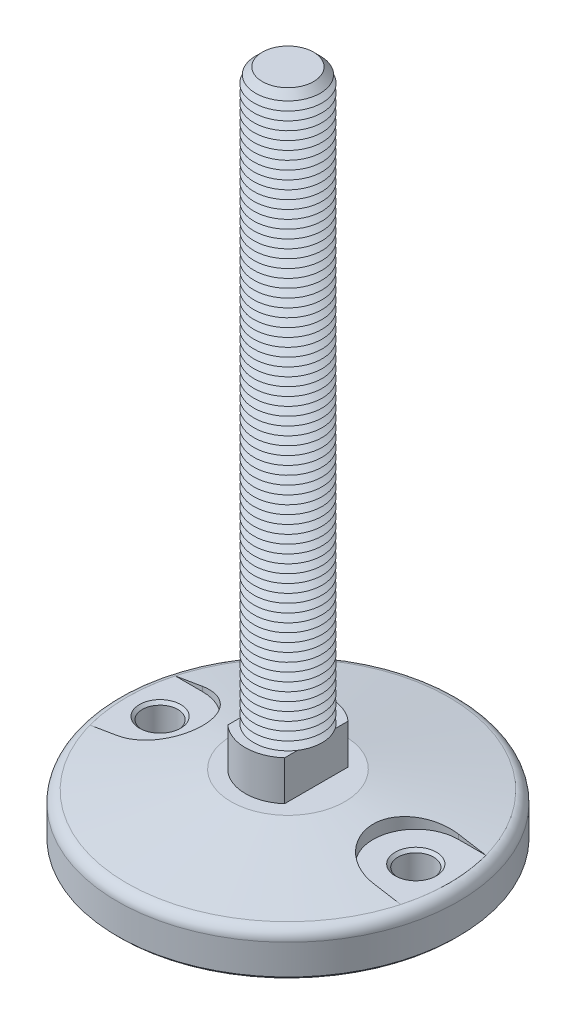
from build123d import *

# Parameters (mm, degrees)
FILLET1_R                = 4
SKETCH3_R                = 15
BOSS_EXTRUDE1_DEPTH      = 14
CUT_EXTRUDE1_START       = -14
CUT_EXTRUDE1_DEPTH       = 14
SKETCH5_R                = 12
BOSS_EXTRUDE2_DEPTH      = 200
CHAMFER1_SIZE            = 3
LPATTERN1_COUNT          = 66
LPATTERN1_PITCH          = 3
CUT_EXTRUDE4_DEPTH       = 6.47
SKETCH10_R               = 6.25
CUT_EXTRUDE5_DEPTH       = 15.53
CHAMFER2_SIZE            = 1
CHAMFER2_OF_MIRROR1_SIZE = 1
CHAMFER3_SIZE            = 1


with BuildPart() as part:
    # Sketch2 → Revolve1 (revolve)
    with BuildSketch(Plane(origin=(0, 0, 0), x_dir=(0, 0, -1), z_dir=(1, 0, 0)), mode=Mode.PRIVATE) as revolve1_sk:
        Polygon((0, 0), (-20, 0), (-60, -7.053079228), (-60, -22), (0, -22), align=None)
    revolve(revolve1_sk.sketch.rotate(Axis((0, 61.338865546, 0), (0, -1, 0)), 180), axis=Axis((0, 61.338865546, 0), (0, -1, 0)))

    # Fillet1
    fillet1_edges = [part.edges().sort_by_distance(p)[0] for p in [
        (0, -7.053079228, 60),
    ]]
    fillet(fillet1_edges, radius=FILLET1_R)

    # Sketch3 → Boss-Extrude1 (add)
    with BuildSketch(Plane(origin=(0, 0, 0), x_dir=(1, 0, 0), z_dir=(0, 1, 0))):
        with Locations(Location((0, 0, 0), (0, 0, 270))):
            Circle(SKETCH3_R)
    extrude(amount=BOSS_EXTRUDE1_DEPTH)

    # Sketch4 → Cut-Extrude1 (cut)
    with BuildSketch(Plane(origin=(0, 14, 0), x_dir=(1, 0, 0), z_dir=(0, 1, 0)).offset(CUT_EXTRUDE1_START)):
        with BuildLine():
            Line((-10, 11.180339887), (-10, -11.180339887))
            ThreePointArc((-10, -11.180339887), (-15, 0), (-10, 11.180339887))
        make_face()
        with BuildLine():
            Line((10, -11.180339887), (10, 11.180339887))
            ThreePointArc((10, 11.180339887), (15, 0), (10, -11.180339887))
        make_face()
    extrude(amount=CUT_EXTRUDE1_DEPTH, mode=Mode.SUBTRACT)

    # Sketch5 → Boss-Extrude2 (add)
    with BuildSketch(Plane(origin=(0, 14, 0), x_dir=(1, 0, 0), z_dir=(0, 1, 0))):
        with Locations(Location((0, 0, 0), (0, 0, 33.557309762))):
            Circle(SKETCH5_R)
    extrude(amount=BOSS_EXTRUDE2_DEPTH)

    # Chamfer1
    chamfer1_edges = [part.edges().sort_by_distance(p)[0] for p in [
        (-10, 214, 6.633249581),
    ]]
    chamfer(chamfer1_edges, length=CHAMFER1_SIZE)

    # Sketch6 → Cut-Revolve1 (revolve, cut)
    with BuildSketch(Plane(origin=(0, 0, 0), x_dir=(0, 0, -1), z_dir=(1, 0, 0))):
        Polygon((-12, 14), (-9.401923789, 15.5), (-12, 17), align=None)
    cut_revolve1 = revolve(axis=Axis((0, 61.338865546, 0), (0, -1, 0)), mode=Mode.SUBTRACT)

    # LPattern1: Cut-Revolve1 ×66
    with Locations(*[(0, i * LPATTERN1_PITCH, 0) for i in range(1, LPATTERN1_COUNT)]):
        add(cut_revolve1, mode=Mode.SUBTRACT)

    # Sketch8 → Cut-Extrude4 (cut)
    with BuildSketch(Plane(origin=(0, 0, 0), x_dir=(1, 0, 0), z_dir=(0, 1, 0))):
        with BuildLine():
            Line((-45, 15), (-54.674279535, 15))
            ThreePointArc((-54.674279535, 15), (-56.694592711, 0), (-54.674279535, -15))
            Line((-54.674279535, -15), (-45, -15))
            ThreePointArc((-45, -15), (-30, 0), (-45, 15))
        make_face()
    cut_extrude4 = extrude(amount=-CUT_EXTRUDE4_DEPTH, mode=Mode.SUBTRACT)

    # Sketch10 → Cut-Extrude5 (cut)
    with BuildSketch(Plane(origin=(0, -6.47, 0), x_dir=(1, 0, 0), z_dir=(0, 1, 0))):
        with Locations(Location((-45, 0, 0), (0, 0, 270))):
            Circle(SKETCH10_R)
    cut_extrude5 = extrude(amount=-CUT_EXTRUDE5_DEPTH, mode=Mode.SUBTRACT)

    # Chamfer2
    chamfer2_edges = [part.edges().sort_by_distance(p)[0] for p in [
        (-45, -6.47, -6.25),
        (-45, -22, -6.25),
    ]]
    chamfer(chamfer2_edges, length=CHAMFER2_SIZE)

    # Mirror1: Cut-Extrude4, Cut-Extrude5 across plane
    add(cut_extrude4.mirror(Plane(origin=(0, 0, 0), x_dir=(0, 0, 1), z_dir=(1, 0, 0))), mode=Mode.SUBTRACT)
    add(cut_extrude5.mirror(Plane(origin=(0, 0, 0), x_dir=(0, 0, 1), z_dir=(1, 0, 0))), mode=Mode.SUBTRACT)

    # Chamfer2 of Mirror1
    chamfer2_of_mirror1_edges = [part.edges().sort_by_distance(p)[0] for p in [
        (45, -6.47, -6.25),
        (45, -22, -6.25),
    ]]
    chamfer(chamfer2_of_mirror1_edges, length=CHAMFER2_OF_MIRROR1_SIZE)

    # Chamfer3
    chamfer3_edges = [part.edges().sort_by_distance(p)[0] for p in [
        (0, -22, 60),
    ]]
    chamfer(chamfer3_edges, length=CHAMFER3_SIZE)


solid = part.part
